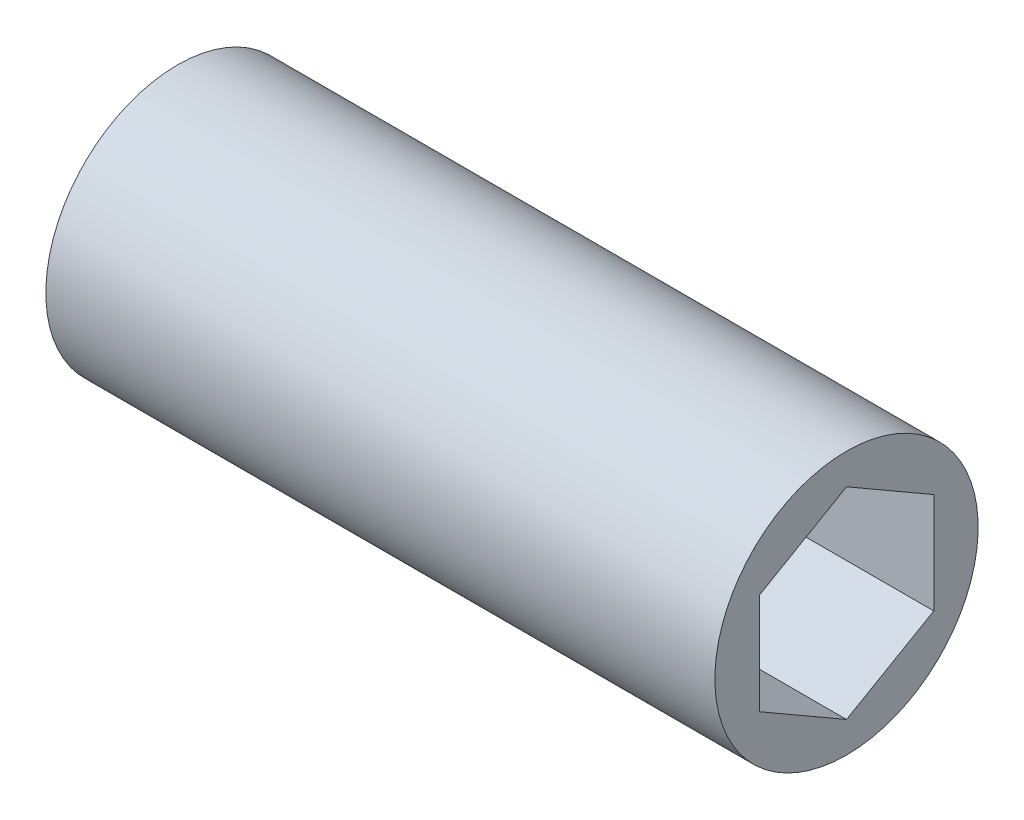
ISO-10303-21;
HEADER;
FILE_DESCRIPTION(('STEP AP214'),'2;1');
FILE_NAME('part.step','',(''),(''),'','','');
FILE_SCHEMA(('AUTOMOTIVE_DESIGN { 1 0 10303 214 1 1 1 1 }'));
ENDSEC;
DATA;
#1=APPLICATION_CONTEXT('core data for automotive mechanical design processes');
#2=APPLICATION_PROTOCOL_DEFINITION('international standard','automotive_design',2000,#1);
#3=PRODUCT_CONTEXT('',#1,'mechanical');
#4=PRODUCT('Part','Part','',(#3));
#5=PRODUCT_RELATED_PRODUCT_CATEGORY('part','',(#4));
#6=PRODUCT_DEFINITION_FORMATION('','',#4);
#7=PRODUCT_DEFINITION_CONTEXT('part definition',#1,'design');
#8=PRODUCT_DEFINITION('design','',#6,#7);
#9=PRODUCT_DEFINITION_SHAPE('','',#8);
#10=(LENGTH_UNIT() NAMED_UNIT(*) SI_UNIT(.MILLI.,.METRE.));
#11=(NAMED_UNIT(*) PLANE_ANGLE_UNIT() SI_UNIT($,.RADIAN.));
#12=(NAMED_UNIT(*) SI_UNIT($,.STERADIAN.) SOLID_ANGLE_UNIT());
#13=UNCERTAINTY_MEASURE_WITH_UNIT(LENGTH_MEASURE(1.E-05),#10,'distance_accuracy_value','');
#14=(GEOMETRIC_REPRESENTATION_CONTEXT(3) GLOBAL_UNCERTAINTY_ASSIGNED_CONTEXT((#13)) GLOBAL_UNIT_ASSIGNED_CONTEXT((#10,
#11,#12)) REPRESENTATION_CONTEXT('',''));
#15=CARTESIAN_POINT('',(0.,0.,0.));
#16=DIRECTION('',(0.,0.,1.));
#17=DIRECTION('',(1.,0.,0.));
#18=AXIS2_PLACEMENT_3D('',#15,#16,#17);
#19=CARTESIAN_POINT('',(-226.060000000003,-295.01791023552,341.513374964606));
#20=DIRECTION('',(1.,0.,0.));
#21=DIRECTION('',(0.,-1.,0.));
#22=AXIS2_PLACEMENT_3D('',#19,#20,#21);
#23=PLANE('',#22);
#24=CARTESIAN_POINT('',(-226.060000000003,-295.01791023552,341.513374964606));
#25=DIRECTION('',(1.,0.,0.));
#26=DIRECTION('',(0.,1.,0.));
#27=AXIS2_PLACEMENT_3D('',#24,#25,#26);
#28=CIRCLE('',#27,9.9949);
#29=CARTESIAN_POINT('',(-226.06,-285.023010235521,341.513374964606));
#30=VERTEX_POINT('',#29);
#31=EDGE_CURVE('E11',#30,#30,#28,.T.);
#32=ORIENTED_EDGE('',*,*,#31,.F.);
#33=EDGE_LOOP('',(#32));
#34=FACE_BOUND('',#33,.T.);
#35=DIRECTION('',(0.,-1.,0.));
#36=VECTOR('',#35,1.);
#37=CARTESIAN_POINT('',(-226.060000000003,-295.01791023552,348.138884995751));
#38=LINE('',#37,#36);
#39=CARTESIAN_POINT('',(-226.060000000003,-291.19267023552,348.138884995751));
#40=VERTEX_POINT('',#39);
#41=CARTESIAN_POINT('',(-226.060000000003,-298.84315023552,348.138884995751));
#42=VERTEX_POINT('',#41);
#43=EDGE_CURVE('E94',#40,#42,#38,.T.);
#44=ORIENTED_EDGE('',*,*,#43,.T.);
#45=DIRECTION('',(0.,-0.5,-0.866025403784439));
#46=VECTOR('',#45,1.);
#47=CARTESIAN_POINT('',(-226.060000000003,-300.75577023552,344.826129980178));
#48=LINE('',#47,#46);
#49=CARTESIAN_POINT('',(-226.060000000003,-302.668390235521,341.513374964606));
#50=VERTEX_POINT('',#49);
#51=EDGE_CURVE('E131',#42,#50,#48,.T.);
#52=ORIENTED_EDGE('',*,*,#51,.T.);
#53=DIRECTION('',(0.,0.5,-0.866025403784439));
#54=VECTOR('',#53,1.);
#55=CARTESIAN_POINT('',(-226.060000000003,-300.75577023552,338.200619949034));
#56=LINE('',#55,#54);
#57=CARTESIAN_POINT('',(-226.060000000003,-298.84315023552,334.887864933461));
#58=VERTEX_POINT('',#57);
#59=EDGE_CURVE('E144',#50,#58,#56,.T.);
#60=ORIENTED_EDGE('',*,*,#59,.T.);
#61=DIRECTION('',(0.,1.,0.));
#62=VECTOR('',#61,1.);
#63=CARTESIAN_POINT('',(-226.060000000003,-295.01791023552,334.887864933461));
#64=LINE('',#63,#62);
#65=CARTESIAN_POINT('',(-226.060000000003,-291.19267023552,334.887864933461));
#66=VERTEX_POINT('',#65);
#67=EDGE_CURVE('E143',#58,#66,#64,.T.);
#68=ORIENTED_EDGE('',*,*,#67,.T.);
#69=DIRECTION('',(0.,0.5,0.866025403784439));
#70=VECTOR('',#69,1.);
#71=CARTESIAN_POINT('',(-226.060000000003,-289.280050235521,338.200619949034));
#72=LINE('',#71,#70);
#73=CARTESIAN_POINT('',(-226.060000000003,-287.36743023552,341.513374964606));
#74=VERTEX_POINT('',#73);
#75=EDGE_CURVE('E96',#66,#74,#72,.T.);
#76=ORIENTED_EDGE('',*,*,#75,.T.);
#77=DIRECTION('',(0.,-0.5,0.866025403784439));
#78=VECTOR('',#77,1.);
#79=CARTESIAN_POINT('',(-226.060000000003,-289.280050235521,344.826129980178));
#80=LINE('',#79,#78);
#81=EDGE_CURVE('E91',#74,#40,#80,.T.);
#82=ORIENTED_EDGE('',*,*,#81,.T.);
#83=EDGE_LOOP('',(#44,#52,#60,#68,#76,#82));
#84=FACE_BOUND('',#83,.T.);
#85=ADVANCED_FACE('F17',(#34,#84),#23,.F.);
#86=CARTESIAN_POINT('',(-175.26,-295.01791023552,341.513374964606));
#87=DIRECTION('',(1.,0.,0.));
#88=DIRECTION('',(0.,-1.,0.));
#89=AXIS2_PLACEMENT_3D('',#86,#87,#88);
#90=PLANE('',#89);
#91=CARTESIAN_POINT('',(-175.26,-295.01791023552,341.513374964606));
#92=DIRECTION('',(1.,0.,0.));
#93=DIRECTION('',(0.,1.,0.));
#94=AXIS2_PLACEMENT_3D('',#91,#92,#93);
#95=CIRCLE('',#94,9.9949);
#96=CARTESIAN_POINT('',(-175.26,-285.023010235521,341.513374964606));
#97=VERTEX_POINT('',#96);
#98=EDGE_CURVE('E25',#97,#97,#95,.T.);
#99=ORIENTED_EDGE('',*,*,#98,.T.);
#100=EDGE_LOOP('',(#99));
#101=FACE_BOUND('',#100,.T.);
#102=DIRECTION('',(0.,-1.,0.));
#103=VECTOR('',#102,1.);
#104=CARTESIAN_POINT('',(-175.26,-295.01791023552,348.138884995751));
#105=LINE('',#104,#103);
#106=CARTESIAN_POINT('',(-175.26,-291.19267023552,348.138884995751));
#107=VERTEX_POINT('',#106);
#108=CARTESIAN_POINT('',(-175.26,-298.84315023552,348.138884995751));
#109=VERTEX_POINT('',#108);
#110=EDGE_CURVE('E113',#107,#109,#105,.T.);
#111=ORIENTED_EDGE('',*,*,#110,.F.);
#112=DIRECTION('',(0.,-0.5,0.866025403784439));
#113=VECTOR('',#112,1.);
#114=CARTESIAN_POINT('',(-175.26,-289.280050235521,344.826129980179));
#115=LINE('',#114,#113);
#116=CARTESIAN_POINT('',(-175.26,-287.367430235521,341.513374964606));
#117=VERTEX_POINT('',#116);
#118=EDGE_CURVE('E108',#117,#107,#115,.T.);
#119=ORIENTED_EDGE('',*,*,#118,.F.);
#120=DIRECTION('',(0.,0.5,0.866025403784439));
#121=VECTOR('',#120,1.);
#122=CARTESIAN_POINT('',(-175.26,-289.280050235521,338.200619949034));
#123=LINE('',#122,#121);
#124=CARTESIAN_POINT('',(-175.26,-291.19267023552,334.887864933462));
#125=VERTEX_POINT('',#124);
#126=EDGE_CURVE('E140',#125,#117,#123,.T.);
#127=ORIENTED_EDGE('',*,*,#126,.F.);
#128=DIRECTION('',(0.,1.,0.));
#129=VECTOR('',#128,1.);
#130=CARTESIAN_POINT('',(-175.26,-295.01791023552,334.887864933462));
#131=LINE('',#130,#129);
#132=CARTESIAN_POINT('',(-175.26,-298.84315023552,334.887864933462));
#133=VERTEX_POINT('',#132);
#134=EDGE_CURVE('E148',#133,#125,#131,.T.);
#135=ORIENTED_EDGE('',*,*,#134,.F.);
#136=DIRECTION('',(0.,0.5,-0.866025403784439));
#137=VECTOR('',#136,1.);
#138=CARTESIAN_POINT('',(-175.26,-300.75577023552,338.200619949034));
#139=LINE('',#138,#137);
#140=CARTESIAN_POINT('',(-175.26,-302.668390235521,341.513374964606));
#141=VERTEX_POINT('',#140);
#142=EDGE_CURVE('E152',#141,#133,#139,.T.);
#143=ORIENTED_EDGE('',*,*,#142,.F.);
#144=DIRECTION('',(0.,-0.5,-0.866025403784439));
#145=VECTOR('',#144,1.);
#146=CARTESIAN_POINT('',(-175.26,-300.75577023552,344.826129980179));
#147=LINE('',#146,#145);
#148=EDGE_CURVE('E128',#109,#141,#147,.T.);
#149=ORIENTED_EDGE('',*,*,#148,.F.);
#150=EDGE_LOOP('',(#111,#119,#127,#135,#143,#149));
#151=FACE_BOUND('',#150,.T.);
#152=ADVANCED_FACE('F194',(#101,#151),#90,.T.);
#153=CARTESIAN_POINT('',(-175.26,-295.01791023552,341.513374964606));
#154=DIRECTION('',(-1.,0.,0.));
#155=DIRECTION('',(0.,-1.,0.));
#156=AXIS2_PLACEMENT_3D('',#153,#154,#155);
#157=CYLINDRICAL_SURFACE('',#156,9.9949);
#158=ORIENTED_EDGE('',*,*,#31,.T.);
#159=EDGE_LOOP('',(#158));
#160=FACE_BOUND('',#159,.T.);
#161=ORIENTED_EDGE('',*,*,#98,.F.);
#162=EDGE_LOOP('',(#161));
#163=FACE_BOUND('',#162,.T.);
#164=ADVANCED_FACE('F198',(#160,#163),#157,.T.);
#165=CARTESIAN_POINT('',(-175.26,-300.75577023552,344.826129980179));
#166=DIRECTION('',(0.,0.866025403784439,-0.5));
#167=DIRECTION('',(-1.,0.,0.));
#168=AXIS2_PLACEMENT_3D('',#165,#166,#167);
#169=PLANE('',#168);
#170=ORIENTED_EDGE('',*,*,#51,.F.);
#171=DIRECTION('',(-1.,0.,0.));
#172=VECTOR('',#171,1.);
#173=CARTESIAN_POINT('',(-175.26,-298.84315023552,348.138884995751));
#174=LINE('',#173,#172);
#175=EDGE_CURVE('E102',#109,#42,#174,.T.);
#176=ORIENTED_EDGE('',*,*,#175,.F.);
#177=ORIENTED_EDGE('',*,*,#148,.T.);
#178=DIRECTION('',(-1.,0.,0.));
#179=VECTOR('',#178,1.);
#180=CARTESIAN_POINT('',(-175.26,-302.668390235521,341.513374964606));
#181=LINE('',#180,#179);
#182=EDGE_CURVE('E147',#141,#50,#181,.T.);
#183=ORIENTED_EDGE('',*,*,#182,.T.);
#184=EDGE_LOOP('',(#170,#176,#177,#183));
#185=FACE_BOUND('',#184,.T.);
#186=ADVANCED_FACE('F213',(#185),#169,.T.);
#187=CARTESIAN_POINT('',(-175.26,-300.75577023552,338.200619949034));
#188=DIRECTION('',(0.,0.866025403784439,0.5));
#189=DIRECTION('',(1.,0.,0.));
#190=AXIS2_PLACEMENT_3D('',#187,#188,#189);
#191=PLANE('',#190);
#192=ORIENTED_EDGE('',*,*,#59,.F.);
#193=ORIENTED_EDGE('',*,*,#182,.F.);
#194=ORIENTED_EDGE('',*,*,#142,.T.);
#195=DIRECTION('',(-1.,0.,0.));
#196=VECTOR('',#195,1.);
#197=CARTESIAN_POINT('',(-175.26,-298.84315023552,334.887864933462));
#198=LINE('',#197,#196);
#199=EDGE_CURVE('E155',#133,#58,#198,.T.);
#200=ORIENTED_EDGE('',*,*,#199,.T.);
#201=EDGE_LOOP('',(#192,#193,#194,#200));
#202=FACE_BOUND('',#201,.T.);
#203=ADVANCED_FACE('F205',(#202),#191,.T.);
#204=CARTESIAN_POINT('',(-175.26,-295.01791023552,334.887864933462));
#205=DIRECTION('',(0.,0.,1.));
#206=DIRECTION('',(1.,0.,0.));
#207=AXIS2_PLACEMENT_3D('',#204,#205,#206);
#208=PLANE('',#207);
#209=ORIENTED_EDGE('',*,*,#67,.F.);
#210=ORIENTED_EDGE('',*,*,#199,.F.);
#211=ORIENTED_EDGE('',*,*,#134,.T.);
#212=DIRECTION('',(-1.,0.,0.));
#213=VECTOR('',#212,1.);
#214=CARTESIAN_POINT('',(-175.26,-291.19267023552,334.887864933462));
#215=LINE('',#214,#213);
#216=EDGE_CURVE('E136',#125,#66,#215,.T.);
#217=ORIENTED_EDGE('',*,*,#216,.T.);
#218=EDGE_LOOP('',(#209,#210,#211,#217));
#219=FACE_BOUND('',#218,.T.);
#220=ADVANCED_FACE('F189',(#219),#208,.T.);
#221=CARTESIAN_POINT('',(-175.26,-289.280050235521,338.200619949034));
#222=DIRECTION('',(0.,-0.866025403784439,0.5));
#223=DIRECTION('',(-1.,0.,0.));
#224=AXIS2_PLACEMENT_3D('',#221,#222,#223);
#225=PLANE('',#224);
#226=ORIENTED_EDGE('',*,*,#75,.F.);
#227=ORIENTED_EDGE('',*,*,#216,.F.);
#228=ORIENTED_EDGE('',*,*,#126,.T.);
#229=DIRECTION('',(-1.,0.,0.));
#230=VECTOR('',#229,1.);
#231=CARTESIAN_POINT('',(-175.26,-287.367430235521,341.513374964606));
#232=LINE('',#231,#230);
#233=EDGE_CURVE('E101',#117,#74,#232,.T.);
#234=ORIENTED_EDGE('',*,*,#233,.T.);
#235=EDGE_LOOP('',(#226,#227,#228,#234));
#236=FACE_BOUND('',#235,.T.);
#237=ADVANCED_FACE('F182',(#236),#225,.T.);
#238=CARTESIAN_POINT('',(-175.26,-289.280050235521,344.826129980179));
#239=DIRECTION('',(0.,-0.866025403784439,-0.5));
#240=DIRECTION('',(0.,0.5,-0.866025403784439));
#241=AXIS2_PLACEMENT_3D('',#238,#239,#240);
#242=PLANE('',#241);
#243=ORIENTED_EDGE('',*,*,#81,.F.);
#244=ORIENTED_EDGE('',*,*,#233,.F.);
#245=ORIENTED_EDGE('',*,*,#118,.T.);
#246=DIRECTION('',(-1.,0.,0.));
#247=VECTOR('',#246,1.);
#248=CARTESIAN_POINT('',(-175.26,-291.19267023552,348.138884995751));
#249=LINE('',#248,#247);
#250=EDGE_CURVE('E105',#107,#40,#249,.T.);
#251=ORIENTED_EDGE('',*,*,#250,.T.);
#252=EDGE_LOOP('',(#243,#244,#245,#251));
#253=FACE_BOUND('',#252,.T.);
#254=ADVANCED_FACE('F106',(#253),#242,.T.);
#255=CARTESIAN_POINT('',(-175.26,-295.01791023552,348.138884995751));
#256=DIRECTION('',(0.,0.,-1.));
#257=DIRECTION('',(0.,-1.,0.));
#258=AXIS2_PLACEMENT_3D('',#255,#256,#257);
#259=PLANE('',#258);
#260=ORIENTED_EDGE('',*,*,#43,.F.);
#261=ORIENTED_EDGE('',*,*,#250,.F.);
#262=ORIENTED_EDGE('',*,*,#110,.T.);
#263=ORIENTED_EDGE('',*,*,#175,.T.);
#264=EDGE_LOOP('',(#260,#261,#262,#263));
#265=FACE_BOUND('',#264,.T.);
#266=ADVANCED_FACE('F116',(#265),#259,.T.);
#267=CLOSED_SHELL('',(#85,#152,#164,#186,#203,#220,#237,#254,#266));
#268=MANIFOLD_SOLID_BREP('B1',#267);
#269=ADVANCED_BREP_SHAPE_REPRESENTATION('',(#18,#268),#14);
#270=SHAPE_DEFINITION_REPRESENTATION(#9,#269);
ENDSEC;
END-ISO-10303-21;
